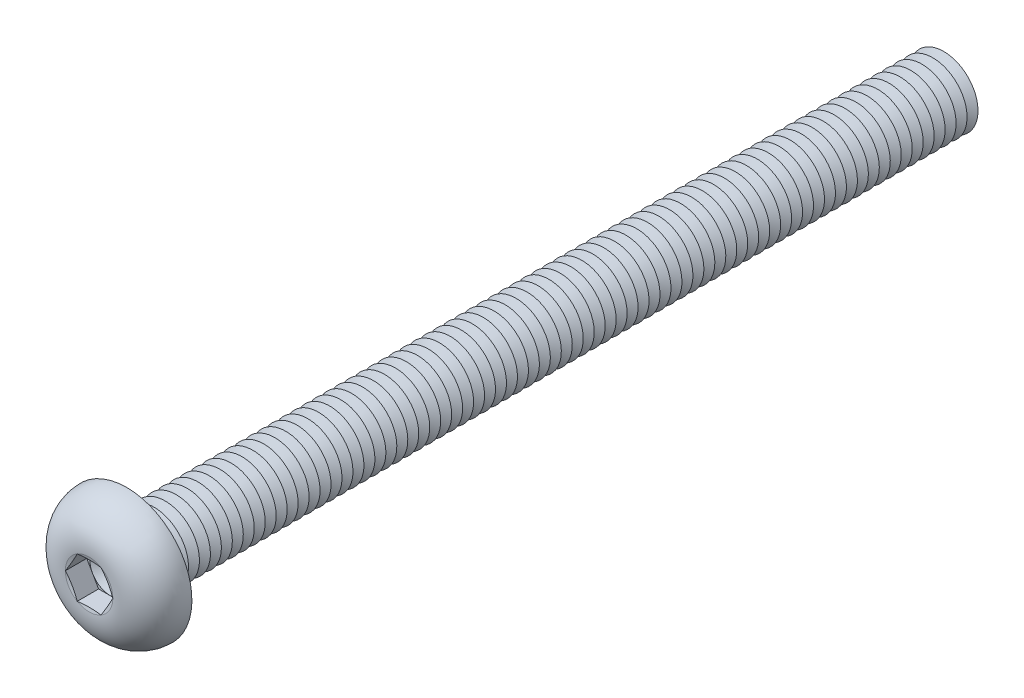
from build123d import *

# Parameters (mm, degrees)
FILLET1_R          = 0.4
LPATTERN1_COUNT    = 75
LPATTERN1_PITCH    = 0.8
CUT_EXTRUDE1_DEPTH = 1.56


with BuildPart() as part:
    # Sketch1 → Revolve1 (revolve)
    with BuildSketch(Plane(origin=(0, 0, 0), x_dir=(0, 0, -1), z_dir=(1, 0, 0))):
        with BuildLine():
            Line((0, 2.5), (0, 4.75))
            ThreePointArc((0, 4.75), (-2.041477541, 3.848329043), (-2.75, 1.73205))
            Line((-2.75, 1.73205), (-2.517949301, 0.866025))
            Line((-2.517949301, 0.866025), (-2.75, 0.866025))
            Line((-2.75, 0.866025), (-2.75, 0))
            Line((-2.75, 0), (60, 0))
            Line((60, 0), (60, 2.5))
            Line((60, 2.5), (0, 2.5))
        make_face()
    revolve(axis=Axis((0, 0, -60), (0, 0, 1)))

    # Fillet1
    fillet1_edges = [part.edges().sort_by_distance(p)[0] for p in [
        (0, -2.5, 0),
    ]]
    fillet(fillet1_edges, radius=FILLET1_R)

    # Sketch2 → Cut-Revolve1 (revolve, cut)
    with BuildSketch(Plane(origin=(0, 0, 0), x_dir=(0, 0, -1), z_dir=(1, 0, 0))):
        Polygon((59.6, 2.5), (60.4, 2.5), (60, 1.807179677), align=None)
    cut_revolve1 = revolve(axis=Axis((0, 0, -60), (0, 0, -1)), mode=Mode.SUBTRACT)

    # LPattern1: Cut-Revolve1 ×75
    with Locations(*[(0, 0, i * LPATTERN1_PITCH) for i in range(1, LPATTERN1_COUNT)]):
        add(cut_revolve1, mode=Mode.SUBTRACT)

    # Sketch3 → Cut-Extrude1 (cut)
    with BuildSketch(Plane.XY.offset(2.75)):
        Polygon((0.866025, 1.499999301), (-0.866025, 1.499999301), (-1.73205, 0), (-0.866025, -1.499999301), (0.866025, -1.499999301), (1.73205, 0), align=None)
    extrude(amount=-CUT_EXTRUDE1_DEPTH, mode=Mode.SUBTRACT)

    # Cut-Extrude2 cone 1 section (on through the dimple's axis) → Cut-Extrude2 (revolve, cut)
    with BuildSketch(Plane(origin=(0, 0, 1.19), x_dir=(0, -1, 0), z_dir=(1, 0, 0))):
        Polygon((0, 0), (1.499999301, 0), (0, 0.866025), align=None)
    revolve(axis=Axis((0, 0, 1.19), (0, 0, -1)), mode=Mode.SUBTRACT)


solid = part.part
